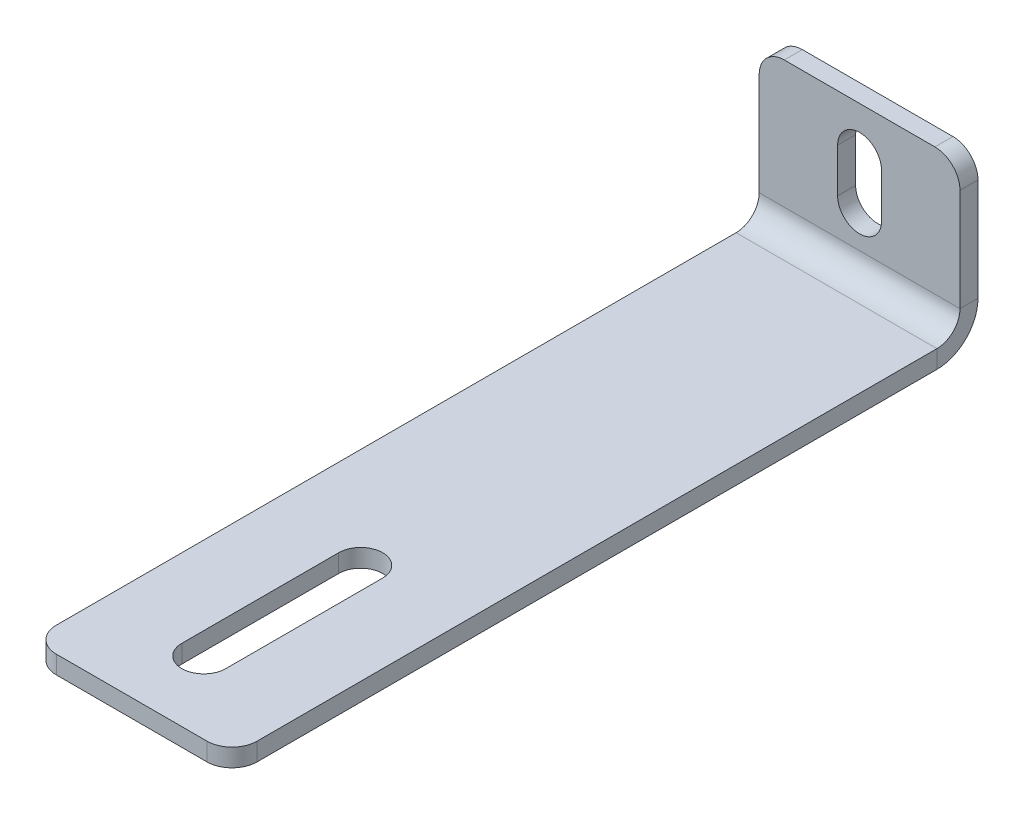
ISO-10303-21;
HEADER;
FILE_DESCRIPTION(('STEP AP214'),'2;1');
FILE_NAME('part.step','',(''),(''),'','','');
FILE_SCHEMA(('AUTOMOTIVE_DESIGN { 1 0 10303 214 1 1 1 1 }'));
ENDSEC;
DATA;
#1=APPLICATION_CONTEXT('core data for automotive mechanical design processes');
#2=APPLICATION_PROTOCOL_DEFINITION('international standard','automotive_design',2000,#1);
#3=PRODUCT_CONTEXT('',#1,'mechanical');
#4=PRODUCT('Part','Part','',(#3));
#5=PRODUCT_RELATED_PRODUCT_CATEGORY('part','',(#4));
#6=PRODUCT_DEFINITION_FORMATION('','',#4);
#7=PRODUCT_DEFINITION_CONTEXT('part definition',#1,'design');
#8=PRODUCT_DEFINITION('design','',#6,#7);
#9=PRODUCT_DEFINITION_SHAPE('','',#8);
#10=(LENGTH_UNIT() NAMED_UNIT(*) SI_UNIT(.MILLI.,.METRE.));
#11=(NAMED_UNIT(*) PLANE_ANGLE_UNIT() SI_UNIT($,.RADIAN.));
#12=(NAMED_UNIT(*) SI_UNIT($,.STERADIAN.) SOLID_ANGLE_UNIT());
#13=UNCERTAINTY_MEASURE_WITH_UNIT(LENGTH_MEASURE(1.E-05),#10,'distance_accuracy_value','');
#14=(GEOMETRIC_REPRESENTATION_CONTEXT(3) GLOBAL_UNCERTAINTY_ASSIGNED_CONTEXT((#13)) GLOBAL_UNIT_ASSIGNED_CONTEXT((#10,
#11,#12)) REPRESENTATION_CONTEXT('',''));
#15=CARTESIAN_POINT('',(0.,0.,0.));
#16=DIRECTION('',(0.,0.,1.));
#17=DIRECTION('',(1.,0.,0.));
#18=AXIS2_PLACEMENT_3D('',#15,#16,#17);
#19=CARTESIAN_POINT('',(5.55625,15.08125,-4.55522));
#20=DIRECTION('',(1.,0.,0.));
#21=DIRECTION('',(0.,1.,0.));
#22=AXIS2_PLACEMENT_3D('',#19,#20,#21);
#23=PLANE('',#22);
#24=DIRECTION('',(0.,-1.,0.));
#25=VECTOR('',#24,1.);
#26=CARTESIAN_POINT('',(5.55625,15.08125,-4.55422));
#27=LINE('',#26,#25);
#28=CARTESIAN_POINT('',(5.55625,26.19375,-4.55422));
#29=VERTEX_POINT('',#28);
#30=CARTESIAN_POINT('',(5.55625,15.08125,-4.55422));
#31=VERTEX_POINT('',#30);
#32=EDGE_CURVE('E182',#29,#31,#27,.T.);
#33=ORIENTED_EDGE('',*,*,#32,.T.);
#34=DIRECTION('',(0.,0.,1.));
#35=VECTOR('',#34,1.);
#36=CARTESIAN_POINT('',(5.55625,15.08125,-4.55522));
#37=LINE('',#36,#35);
#38=CARTESIAN_POINT('',(5.55625,15.08125,0.));
#39=VERTEX_POINT('',#38);
#40=EDGE_CURVE('E235',#31,#39,#37,.T.);
#41=ORIENTED_EDGE('',*,*,#40,.T.);
#42=DIRECTION('',(0.,1.,0.));
#43=VECTOR('',#42,1.);
#44=CARTESIAN_POINT('',(5.55625,15.08125,0.));
#45=LINE('',#44,#43);
#46=CARTESIAN_POINT('',(5.55625,26.19375,0.));
#47=VERTEX_POINT('',#46);
#48=EDGE_CURVE('E185',#39,#47,#45,.T.);
#49=ORIENTED_EDGE('',*,*,#48,.T.);
#50=DIRECTION('',(0.,0.,1.));
#51=VECTOR('',#50,1.);
#52=CARTESIAN_POINT('',(5.55625,26.19375,-4.55522));
#53=LINE('',#52,#51);
#54=EDGE_CURVE('E9',#29,#47,#53,.T.);
#55=ORIENTED_EDGE('',*,*,#54,.F.);
#56=EDGE_LOOP('',(#33,#41,#49,#55));
#57=FACE_BOUND('',#56,.T.);
#58=ADVANCED_FACE('F14',(#57),#23,.F.);
#59=CARTESIAN_POINT('',(0.,26.19375,-4.55522));
#60=DIRECTION('',(0.,0.,1.));
#61=DIRECTION('',(1.,0.,0.));
#62=AXIS2_PLACEMENT_3D('',#59,#60,#61);
#63=CYLINDRICAL_SURFACE('',#62,5.55625);
#64=CARTESIAN_POINT('',(0.,26.19375,-4.55422));
#65=DIRECTION('',(0.,0.,-1.));
#66=DIRECTION('',(1.,0.,0.));
#67=AXIS2_PLACEMENT_3D('',#64,#65,#66);
#68=CIRCLE('',#67,5.55625);
#69=CARTESIAN_POINT('',(-5.55625,26.19375,-4.55422));
#70=VERTEX_POINT('',#69);
#71=EDGE_CURVE('E190',#70,#29,#68,.T.);
#72=ORIENTED_EDGE('',*,*,#71,.T.);
#73=ORIENTED_EDGE('',*,*,#54,.T.);
#74=CARTESIAN_POINT('',(0.,26.19375,0.));
#75=DIRECTION('',(0.,0.,1.));
#76=DIRECTION('',(1.,0.,0.));
#77=AXIS2_PLACEMENT_3D('',#74,#75,#76);
#78=CIRCLE('',#77,5.55625);
#79=CARTESIAN_POINT('',(-5.55625,26.19375,0.));
#80=VERTEX_POINT('',#79);
#81=EDGE_CURVE('E284',#47,#80,#78,.T.);
#82=ORIENTED_EDGE('',*,*,#81,.T.);
#83=DIRECTION('',(0.,0.,1.));
#84=VECTOR('',#83,1.);
#85=CARTESIAN_POINT('',(-5.55625,26.19375,-4.55522));
#86=LINE('',#85,#84);
#87=EDGE_CURVE('E25',#70,#80,#86,.T.);
#88=ORIENTED_EDGE('',*,*,#87,.F.);
#89=EDGE_LOOP('',(#72,#73,#82,#88));
#90=FACE_BOUND('',#89,.T.);
#91=ADVANCED_FACE('F191',(#90),#63,.F.);
#92=CARTESIAN_POINT('',(-5.55625,15.08125,-4.55522));
#93=DIRECTION('',(-1.,0.,0.));
#94=DIRECTION('',(0.,1.,0.));
#95=AXIS2_PLACEMENT_3D('',#92,#93,#94);
#96=PLANE('',#95);
#97=DIRECTION('',(0.,1.,0.));
#98=VECTOR('',#97,1.);
#99=CARTESIAN_POINT('',(-5.55625,15.08125,-4.55422));
#100=LINE('',#99,#98);
#101=CARTESIAN_POINT('',(-5.55625,15.08125,-4.55422));
#102=VERTEX_POINT('',#101);
#103=EDGE_CURVE('E208',#102,#70,#100,.T.);
#104=ORIENTED_EDGE('',*,*,#103,.T.);
#105=ORIENTED_EDGE('',*,*,#87,.T.);
#106=DIRECTION('',(0.,-1.,0.));
#107=VECTOR('',#106,1.);
#108=CARTESIAN_POINT('',(-5.55625,15.08125,0.));
#109=LINE('',#108,#107);
#110=CARTESIAN_POINT('',(-5.55625,15.08125,0.));
#111=VERTEX_POINT('',#110);
#112=EDGE_CURVE('E287',#80,#111,#109,.T.);
#113=ORIENTED_EDGE('',*,*,#112,.T.);
#114=DIRECTION('',(0.,0.,1.));
#115=VECTOR('',#114,1.);
#116=CARTESIAN_POINT('',(-5.55625,15.08125,-4.55522));
#117=LINE('',#116,#115);
#118=EDGE_CURVE('E238',#102,#111,#117,.T.);
#119=ORIENTED_EDGE('',*,*,#118,.F.);
#120=EDGE_LOOP('',(#104,#105,#113,#119));
#121=FACE_BOUND('',#120,.T.);
#122=ADVANCED_FACE('F518',(#121),#96,.F.);
#123=CARTESIAN_POINT('',(0.,15.08125,-4.55522));
#124=DIRECTION('',(0.,0.,1.));
#125=DIRECTION('',(1.,0.,0.));
#126=AXIS2_PLACEMENT_3D('',#123,#124,#125);
#127=CYLINDRICAL_SURFACE('',#126,5.55625);
#128=CARTESIAN_POINT('',(0.,15.08125,-4.55422));
#129=DIRECTION('',(0.,0.,-1.));
#130=DIRECTION('',(1.,0.,0.));
#131=AXIS2_PLACEMENT_3D('',#128,#129,#130);
#132=CIRCLE('',#131,5.55625);
#133=EDGE_CURVE('E201',#31,#102,#132,.T.);
#134=ORIENTED_EDGE('',*,*,#133,.T.);
#135=ORIENTED_EDGE('',*,*,#118,.T.);
#136=CARTESIAN_POINT('',(0.,15.08125,0.));
#137=DIRECTION('',(0.,0.,1.));
#138=DIRECTION('',(1.,0.,0.));
#139=AXIS2_PLACEMENT_3D('',#136,#137,#138);
#140=CIRCLE('',#139,5.55625);
#141=EDGE_CURVE('E303',#111,#39,#140,.T.);
#142=ORIENTED_EDGE('',*,*,#141,.T.);
#143=ORIENTED_EDGE('',*,*,#40,.F.);
#144=EDGE_LOOP('',(#134,#135,#142,#143));
#145=FACE_BOUND('',#144,.T.);
#146=ADVANCED_FACE('F509',(#145),#127,.F.);
#147=CARTESIAN_POINT('',(5.55625,-4.55522,165.89375));
#148=DIRECTION('',(1.,0.,0.));
#149=DIRECTION('',(0.,0.,-1.));
#150=AXIS2_PLACEMENT_3D('',#147,#148,#149);
#151=PLANE('',#150);
#152=DIRECTION('',(0.,0.,1.));
#153=VECTOR('',#152,1.);
#154=CARTESIAN_POINT('',(5.55625,-4.55422,165.89375));
#155=LINE('',#154,#153);
#156=CARTESIAN_POINT('',(5.55625,-4.55422,126.20625));
#157=VERTEX_POINT('',#156);
#158=CARTESIAN_POINT('',(5.55625,-4.55422,165.89375));
#159=VERTEX_POINT('',#158);
#160=EDGE_CURVE('E229',#157,#159,#155,.T.);
#161=ORIENTED_EDGE('',*,*,#160,.T.);
#162=DIRECTION('',(0.,1.,0.));
#163=VECTOR('',#162,1.);
#164=CARTESIAN_POINT('',(5.55625,-4.55522,165.89375));
#165=LINE('',#164,#163);
#166=CARTESIAN_POINT('',(5.55625,0.,165.89375));
#167=VERTEX_POINT('',#166);
#168=EDGE_CURVE('E319',#159,#167,#165,.T.);
#169=ORIENTED_EDGE('',*,*,#168,.T.);
#170=DIRECTION('',(0.,0.,-1.));
#171=VECTOR('',#170,1.);
#172=CARTESIAN_POINT('',(5.55625,0.,165.89375));
#173=LINE('',#172,#171);
#174=CARTESIAN_POINT('',(5.55625,0.,126.20625));
#175=VERTEX_POINT('',#174);
#176=EDGE_CURVE('E283',#167,#175,#173,.T.);
#177=ORIENTED_EDGE('',*,*,#176,.T.);
#178=DIRECTION('',(0.,1.,0.));
#179=VECTOR('',#178,1.);
#180=CARTESIAN_POINT('',(5.55625,-4.55522,126.20625));
#181=LINE('',#180,#179);
#182=EDGE_CURVE('E40',#157,#175,#181,.T.);
#183=ORIENTED_EDGE('',*,*,#182,.F.);
#184=EDGE_LOOP('',(#161,#169,#177,#183));
#185=FACE_BOUND('',#184,.T.);
#186=ADVANCED_FACE('F491',(#185),#151,.F.);
#187=CARTESIAN_POINT('',(0.,-4.55522,126.20625));
#188=DIRECTION('',(0.,1.,0.));
#189=DIRECTION('',(0.,0.,1.));
#190=AXIS2_PLACEMENT_3D('',#187,#188,#189);
#191=CYLINDRICAL_SURFACE('',#190,5.55625);
#192=CARTESIAN_POINT('',(0.,-4.55422,126.20625));
#193=DIRECTION('',(0.,-1.,0.));
#194=DIRECTION('',(0.,0.,1.));
#195=AXIS2_PLACEMENT_3D('',#192,#193,#194);
#196=CIRCLE('',#195,5.55625);
#197=CARTESIAN_POINT('',(-5.55625,-4.55422,126.20625));
#198=VERTEX_POINT('',#197);
#199=EDGE_CURVE('E298',#198,#157,#196,.T.);
#200=ORIENTED_EDGE('',*,*,#199,.T.);
#201=ORIENTED_EDGE('',*,*,#182,.T.);
#202=CARTESIAN_POINT('',(0.,0.,126.20625));
#203=DIRECTION('',(0.,1.,0.));
#204=DIRECTION('',(0.,0.,1.));
#205=AXIS2_PLACEMENT_3D('',#202,#203,#204);
#206=CIRCLE('',#205,5.55625);
#207=CARTESIAN_POINT('',(-5.55625,0.,126.20625));
#208=VERTEX_POINT('',#207);
#209=EDGE_CURVE('E360',#175,#208,#206,.T.);
#210=ORIENTED_EDGE('',*,*,#209,.T.);
#211=DIRECTION('',(0.,1.,0.));
#212=VECTOR('',#211,1.);
#213=CARTESIAN_POINT('',(-5.55625,-4.55522,126.20625));
#214=LINE('',#213,#212);
#215=EDGE_CURVE('E158',#198,#208,#214,.T.);
#216=ORIENTED_EDGE('',*,*,#215,.F.);
#217=EDGE_LOOP('',(#200,#201,#210,#216));
#218=FACE_BOUND('',#217,.T.);
#219=ADVANCED_FACE('F500',(#218),#191,.F.);
#220=CARTESIAN_POINT('',(-5.55625,-4.55522,165.89375));
#221=DIRECTION('',(-1.,0.,0.));
#222=DIRECTION('',(0.,0.,1.));
#223=AXIS2_PLACEMENT_3D('',#220,#221,#222);
#224=PLANE('',#223);
#225=DIRECTION('',(0.,0.,-1.));
#226=VECTOR('',#225,1.);
#227=CARTESIAN_POINT('',(-5.55625,-4.55422,165.89375));
#228=LINE('',#227,#226);
#229=CARTESIAN_POINT('',(-5.55625,-4.55422,165.89375));
#230=VERTEX_POINT('',#229);
#231=EDGE_CURVE('E230',#230,#198,#228,.T.);
#232=ORIENTED_EDGE('',*,*,#231,.T.);
#233=ORIENTED_EDGE('',*,*,#215,.T.);
#234=DIRECTION('',(0.,0.,1.));
#235=VECTOR('',#234,1.);
#236=CARTESIAN_POINT('',(-5.55625,0.,165.89375));
#237=LINE('',#236,#235);
#238=CARTESIAN_POINT('',(-5.55625,0.,165.89375));
#239=VERTEX_POINT('',#238);
#240=EDGE_CURVE('E376',#208,#239,#237,.T.);
#241=ORIENTED_EDGE('',*,*,#240,.T.);
#242=DIRECTION('',(0.,1.,0.));
#243=VECTOR('',#242,1.);
#244=CARTESIAN_POINT('',(-5.55625,-4.55522,165.89375));
#245=LINE('',#244,#243);
#246=EDGE_CURVE('E332',#230,#239,#245,.T.);
#247=ORIENTED_EDGE('',*,*,#246,.F.);
#248=EDGE_LOOP('',(#232,#233,#241,#247));
#249=FACE_BOUND('',#248,.T.);
#250=ADVANCED_FACE('F487',(#249),#224,.F.);
#251=CARTESIAN_POINT('',(0.,-4.55522,165.89375));
#252=DIRECTION('',(0.,1.,0.));
#253=DIRECTION('',(0.,0.,1.));
#254=AXIS2_PLACEMENT_3D('',#251,#252,#253);
#255=CYLINDRICAL_SURFACE('',#254,5.55625);
#256=CARTESIAN_POINT('',(0.,-4.55422,165.89375));
#257=DIRECTION('',(0.,-1.,0.));
#258=DIRECTION('',(0.,0.,1.));
#259=AXIS2_PLACEMENT_3D('',#256,#257,#258);
#260=CIRCLE('',#259,5.55625);
#261=EDGE_CURVE('E225',#159,#230,#260,.T.);
#262=ORIENTED_EDGE('',*,*,#261,.T.);
#263=ORIENTED_EDGE('',*,*,#246,.T.);
#264=CARTESIAN_POINT('',(0.,0.,165.89375));
#265=DIRECTION('',(0.,1.,0.));
#266=DIRECTION('',(0.,0.,1.));
#267=AXIS2_PLACEMENT_3D('',#264,#265,#266);
#268=CIRCLE('',#267,5.55625);
#269=EDGE_CURVE('E379',#239,#167,#268,.T.);
#270=ORIENTED_EDGE('',*,*,#269,.T.);
#271=ORIENTED_EDGE('',*,*,#168,.F.);
#272=EDGE_LOOP('',(#262,#263,#270,#271));
#273=FACE_BOUND('',#272,.T.);
#274=ADVANCED_FACE('F482',(#273),#255,.F.);
#275=CARTESIAN_POINT('',(19.05,31.75,0.));
#276=DIRECTION('',(0.,0.,-1.));
#277=DIRECTION('',(-1.,0.,0.));
#278=AXIS2_PLACEMENT_3D('',#275,#276,#277);
#279=CYLINDRICAL_SURFACE('',#278,6.35);
#280=CARTESIAN_POINT('',(19.05,31.75,0.));
#281=DIRECTION('',(0.,0.,1.));
#282=DIRECTION('',(1.,0.,0.));
#283=AXIS2_PLACEMENT_3D('',#280,#281,#282);
#284=CIRCLE('',#283,6.35);
#285=CARTESIAN_POINT('',(25.4,31.75,0.));
#286=VERTEX_POINT('',#285);
#287=CARTESIAN_POINT('',(19.05,38.1,0.));
#288=VERTEX_POINT('',#287);
#289=EDGE_CURVE('E299',#286,#288,#284,.T.);
#290=ORIENTED_EDGE('',*,*,#289,.F.);
#291=DIRECTION('',(0.,0.,1.));
#292=VECTOR('',#291,1.);
#293=CARTESIAN_POINT('',(25.4,31.75,5.842));
#294=LINE('',#293,#292);
#295=CARTESIAN_POINT('',(25.4,31.75,-4.55422));
#296=VERTEX_POINT('',#295);
#297=EDGE_CURVE('E275',#296,#286,#294,.T.);
#298=ORIENTED_EDGE('',*,*,#297,.F.);
#299=CARTESIAN_POINT('',(19.05,31.75,-4.55422));
#300=DIRECTION('',(0.,0.,-1.));
#301=DIRECTION('',(1.,0.,0.));
#302=AXIS2_PLACEMENT_3D('',#299,#300,#301);
#303=CIRCLE('',#302,6.35);
#304=CARTESIAN_POINT('',(19.05,38.1,-4.55422));
#305=VERTEX_POINT('',#304);
#306=EDGE_CURVE('E234',#305,#296,#303,.T.);
#307=ORIENTED_EDGE('',*,*,#306,.F.);
#308=DIRECTION('',(0.,0.,-1.));
#309=VECTOR('',#308,1.);
#310=CARTESIAN_POINT('',(19.05,38.1,0.));
#311=LINE('',#310,#309);
#312=EDGE_CURVE('E244',#288,#305,#311,.T.);
#313=ORIENTED_EDGE('',*,*,#312,.F.);
#314=EDGE_LOOP('',(#290,#298,#307,#313));
#315=FACE_BOUND('',#314,.T.);
#316=ADVANCED_FACE('F554',(#315),#279,.T.);
#317=CARTESIAN_POINT('',(-19.05,31.75,5.842));
#318=DIRECTION('',(0.,0.,-1.));
#319=DIRECTION('',(-1.,0.,0.));
#320=AXIS2_PLACEMENT_3D('',#317,#318,#319);
#321=CYLINDRICAL_SURFACE('',#320,6.35);
#322=CARTESIAN_POINT('',(-19.05,31.75,0.));
#323=DIRECTION('',(0.,0.,1.));
#324=DIRECTION('',(1.,0.,0.));
#325=AXIS2_PLACEMENT_3D('',#322,#323,#324);
#326=CIRCLE('',#325,6.35);
#327=CARTESIAN_POINT('',(-19.05,38.1,0.));
#328=VERTEX_POINT('',#327);
#329=CARTESIAN_POINT('',(-25.4,31.75,0.));
#330=VERTEX_POINT('',#329);
#331=EDGE_CURVE('E239',#328,#330,#326,.T.);
#332=ORIENTED_EDGE('',*,*,#331,.F.);
#333=DIRECTION('',(0.,0.,1.));
#334=VECTOR('',#333,1.);
#335=CARTESIAN_POINT('',(-19.05,38.1,0.));
#336=LINE('',#335,#334);
#337=CARTESIAN_POINT('',(-19.05,38.1,-4.55422));
#338=VERTEX_POINT('',#337);
#339=EDGE_CURVE('E196',#338,#328,#336,.T.);
#340=ORIENTED_EDGE('',*,*,#339,.F.);
#341=CARTESIAN_POINT('',(-19.05,31.75,-4.55422));
#342=DIRECTION('',(0.,0.,-1.));
#343=DIRECTION('',(1.,0.,0.));
#344=AXIS2_PLACEMENT_3D('',#341,#342,#343);
#345=CIRCLE('',#344,6.35);
#346=CARTESIAN_POINT('',(-25.4,31.75,-4.55422));
#347=VERTEX_POINT('',#346);
#348=EDGE_CURVE('E308',#347,#338,#345,.T.);
#349=ORIENTED_EDGE('',*,*,#348,.F.);
#350=DIRECTION('',(0.,0.,-1.));
#351=VECTOR('',#350,1.);
#352=CARTESIAN_POINT('',(-25.4,31.75,5.842));
#353=LINE('',#352,#351);
#354=EDGE_CURVE('E212',#330,#347,#353,.T.);
#355=ORIENTED_EDGE('',*,*,#354,.F.);
#356=EDGE_LOOP('',(#332,#340,#349,#355));
#357=FACE_BOUND('',#356,.T.);
#358=ADVANCED_FACE('F544',(#357),#321,.T.);
#359=CARTESIAN_POINT('',(19.05,-4.55422,177.8));
#360=DIRECTION('',(0.,-1.,0.));
#361=DIRECTION('',(0.,0.,-1.));
#362=AXIS2_PLACEMENT_3D('',#359,#360,#361);
#363=CYLINDRICAL_SURFACE('',#362,6.35);
#364=CARTESIAN_POINT('',(19.05,-4.55422,177.8));
#365=DIRECTION('',(0.,-1.,0.));
#366=DIRECTION('',(0.,0.,1.));
#367=AXIS2_PLACEMENT_3D('',#364,#365,#366);
#368=CIRCLE('',#367,6.35);
#369=CARTESIAN_POINT('',(25.4,-4.55422,177.8));
#370=VERTEX_POINT('',#369);
#371=CARTESIAN_POINT('',(19.05,-4.55422,184.15));
#372=VERTEX_POINT('',#371);
#373=EDGE_CURVE('E223',#370,#372,#368,.T.);
#374=ORIENTED_EDGE('',*,*,#373,.F.);
#375=DIRECTION('',(0.,-1.,0.));
#376=VECTOR('',#375,1.);
#377=CARTESIAN_POINT('',(25.4,-4.55422,177.8));
#378=LINE('',#377,#376);
#379=CARTESIAN_POINT('',(25.4,0.,177.8));
#380=VERTEX_POINT('',#379);
#381=EDGE_CURVE('E341',#380,#370,#378,.T.);
#382=ORIENTED_EDGE('',*,*,#381,.F.);
#383=CARTESIAN_POINT('',(19.05,0.,177.8));
#384=DIRECTION('',(0.,1.,0.));
#385=DIRECTION('',(0.,0.,1.));
#386=AXIS2_PLACEMENT_3D('',#383,#384,#385);
#387=CIRCLE('',#386,6.35);
#388=CARTESIAN_POINT('',(19.05,0.,184.15));
#389=VERTEX_POINT('',#388);
#390=EDGE_CURVE('E361',#389,#380,#387,.T.);
#391=ORIENTED_EDGE('',*,*,#390,.F.);
#392=DIRECTION('',(0.,1.,0.));
#393=VECTOR('',#392,1.);
#394=CARTESIAN_POINT('',(19.05,0.,184.15));
#395=LINE('',#394,#393);
#396=EDGE_CURVE('E247',#372,#389,#395,.T.);
#397=ORIENTED_EDGE('',*,*,#396,.F.);
#398=EDGE_LOOP('',(#374,#382,#391,#397));
#399=FACE_BOUND('',#398,.T.);
#400=ADVANCED_FACE('F530',(#399),#363,.T.);
#401=CARTESIAN_POINT('',(-19.05,5.842,177.8));
#402=DIRECTION('',(0.,1.,0.));
#403=DIRECTION('',(0.,0.,1.));
#404=AXIS2_PLACEMENT_3D('',#401,#402,#403);
#405=CYLINDRICAL_SURFACE('',#404,6.35);
#406=CARTESIAN_POINT('',(-19.05,-4.55422,177.8));
#407=DIRECTION('',(0.,-1.,0.));
#408=DIRECTION('',(0.,0.,1.));
#409=AXIS2_PLACEMENT_3D('',#406,#407,#408);
#410=CIRCLE('',#409,6.35);
#411=CARTESIAN_POINT('',(-19.05,-4.55422,184.15));
#412=VERTEX_POINT('',#411);
#413=CARTESIAN_POINT('',(-25.4,-4.55422,177.8));
#414=VERTEX_POINT('',#413);
#415=EDGE_CURVE('E111',#412,#414,#410,.T.);
#416=ORIENTED_EDGE('',*,*,#415,.F.);
#417=DIRECTION('',(0.,-1.,0.));
#418=VECTOR('',#417,1.);
#419=CARTESIAN_POINT('',(-19.05,-4.55422,184.15));
#420=LINE('',#419,#418);
#421=CARTESIAN_POINT('',(-19.05,0.,184.15));
#422=VERTEX_POINT('',#421);
#423=EDGE_CURVE('E248',#422,#412,#420,.T.);
#424=ORIENTED_EDGE('',*,*,#423,.F.);
#425=CARTESIAN_POINT('',(-19.05,0.,177.8));
#426=DIRECTION('',(0.,1.,0.));
#427=DIRECTION('',(0.,0.,1.));
#428=AXIS2_PLACEMENT_3D('',#425,#426,#427);
#429=CIRCLE('',#428,6.35);
#430=CARTESIAN_POINT('',(-25.4,0.,177.8));
#431=VERTEX_POINT('',#430);
#432=EDGE_CURVE('E93',#431,#422,#429,.T.);
#433=ORIENTED_EDGE('',*,*,#432,.F.);
#434=DIRECTION('',(0.,1.,0.));
#435=VECTOR('',#434,1.);
#436=CARTESIAN_POINT('',(-25.4,5.842,177.8));
#437=LINE('',#436,#435);
#438=EDGE_CURVE('E290',#414,#431,#437,.T.);
#439=ORIENTED_EDGE('',*,*,#438,.F.);
#440=EDGE_LOOP('',(#416,#424,#433,#439));
#441=FACE_BOUND('',#440,.T.);
#442=ADVANCED_FACE('F527',(#441),#405,.T.);
#443=CARTESIAN_POINT('',(-25.4,5.842,5.842));
#444=DIRECTION('',(-1.,0.,0.));
#445=DIRECTION('',(0.,0.,1.));
#446=AXIS2_PLACEMENT_3D('',#443,#444,#445);
#447=PLANE('',#446);
#448=DIRECTION('',(0.,1.,0.));
#449=VECTOR('',#448,1.);
#450=CARTESIAN_POINT('',(-25.4,0.,0.));
#451=LINE('',#450,#449);
#452=CARTESIAN_POINT('',(-25.4,5.842,0.));
#453=VERTEX_POINT('',#452);
#454=EDGE_CURVE('E243',#453,#330,#451,.T.);
#455=ORIENTED_EDGE('',*,*,#454,.T.);
#456=ORIENTED_EDGE('',*,*,#354,.T.);
#457=DIRECTION('',(0.,1.,0.));
#458=VECTOR('',#457,1.);
#459=CARTESIAN_POINT('',(-25.4,0.,-4.55422));
#460=LINE('',#459,#458);
#461=CARTESIAN_POINT('',(-25.4,5.842,-4.55422));
#462=VERTEX_POINT('',#461);
#463=EDGE_CURVE('E305',#462,#347,#460,.T.);
#464=ORIENTED_EDGE('',*,*,#463,.F.);
#465=DIRECTION('',(0.,0.,1.));
#466=VECTOR('',#465,1.);
#467=CARTESIAN_POINT('',(-25.4,5.842,-4.55422));
#468=LINE('',#467,#466);
#469=EDGE_CURVE('E313',#462,#453,#468,.T.);
#470=ORIENTED_EDGE('',*,*,#469,.T.);
#471=EDGE_LOOP('',(#455,#456,#464,#470));
#472=FACE_BOUND('',#471,.T.);
#473=ADVANCED_FACE('F524',(#472),#447,.T.);
#474=CARTESIAN_POINT('',(25.4,5.842,5.842));
#475=DIRECTION('',(-1.,0.,0.));
#476=DIRECTION('',(0.,0.,1.));
#477=AXIS2_PLACEMENT_3D('',#474,#475,#476);
#478=PLANE('',#477);
#479=DIRECTION('',(0.,0.,-1.));
#480=VECTOR('',#479,1.);
#481=CARTESIAN_POINT('',(25.4,0.,184.15));
#482=LINE('',#481,#480);
#483=CARTESIAN_POINT('',(25.4,0.,5.842));
#484=VERTEX_POINT('',#483);
#485=EDGE_CURVE('E365',#380,#484,#482,.T.);
#486=ORIENTED_EDGE('',*,*,#485,.F.);
#487=ORIENTED_EDGE('',*,*,#381,.T.);
#488=DIRECTION('',(0.,0.,-1.));
#489=VECTOR('',#488,1.);
#490=CARTESIAN_POINT('',(25.4,-4.55422,184.15));
#491=LINE('',#490,#489);
#492=CARTESIAN_POINT('',(25.4,-4.55422,5.842));
#493=VERTEX_POINT('',#492);
#494=EDGE_CURVE('E220',#370,#493,#491,.T.);
#495=ORIENTED_EDGE('',*,*,#494,.T.);
#496=DIRECTION('',(0.,1.,0.));
#497=VECTOR('',#496,1.);
#498=CARTESIAN_POINT('',(25.4,-4.55422,5.842));
#499=LINE('',#498,#497);
#500=EDGE_CURVE('E269',#493,#484,#499,.T.);
#501=ORIENTED_EDGE('',*,*,#500,.T.);
#502=EDGE_LOOP('',(#486,#487,#495,#501));
#503=FACE_BOUND('',#502,.T.);
#504=ADVANCED_FACE('F433',(#503),#478,.F.);
#505=CARTESIAN_POINT('',(25.4,5.842,5.842));
#506=DIRECTION('',(-1.,0.,0.));
#507=DIRECTION('',(0.,0.,1.));
#508=AXIS2_PLACEMENT_3D('',#505,#506,#507);
#509=CYLINDRICAL_SURFACE('',#508,10.39622);
#510=CARTESIAN_POINT('',(-25.4,5.842,5.842));
#511=DIRECTION('',(1.,0.,0.));
#512=DIRECTION('',(0.,0.,-1.));
#513=AXIS2_PLACEMENT_3D('',#510,#511,#512);
#514=CIRCLE('',#513,10.39622);
#515=CARTESIAN_POINT('',(-25.4,-4.55422,5.842));
#516=VERTEX_POINT('',#515);
#517=EDGE_CURVE('E18',#516,#462,#514,.T.);
#518=ORIENTED_EDGE('',*,*,#517,.T.);
#519=DIRECTION('',(-1.,0.,0.));
#520=VECTOR('',#519,1.);
#521=CARTESIAN_POINT('',(25.4,5.842,-4.55422));
#522=LINE('',#521,#520);
#523=CARTESIAN_POINT('',(25.4,5.842,-4.55422));
#524=VERTEX_POINT('',#523);
#525=EDGE_CURVE('E231',#524,#462,#522,.T.);
#526=ORIENTED_EDGE('',*,*,#525,.F.);
#527=CARTESIAN_POINT('',(25.4,5.842,5.842));
#528=DIRECTION('',(1.,0.,0.));
#529=DIRECTION('',(0.,0.,-1.));
#530=AXIS2_PLACEMENT_3D('',#527,#528,#529);
#531=CIRCLE('',#530,10.39622);
#532=EDGE_CURVE('E273',#493,#524,#531,.T.);
#533=ORIENTED_EDGE('',*,*,#532,.F.);
#534=DIRECTION('',(-1.,0.,0.));
#535=VECTOR('',#534,1.);
#536=CARTESIAN_POINT('',(25.4,-4.55422,5.842));
#537=LINE('',#536,#535);
#538=EDGE_CURVE('E224',#493,#516,#537,.T.);
#539=ORIENTED_EDGE('',*,*,#538,.T.);
#540=EDGE_LOOP('',(#518,#526,#533,#539));
#541=FACE_BOUND('',#540,.T.);
#542=ADVANCED_FACE('F537',(#541),#509,.T.);
#543=CARTESIAN_POINT('',(25.4,-4.55422,184.15));
#544=DIRECTION('',(0.,1.,0.));
#545=DIRECTION('',(1.,0.,0.));
#546=AXIS2_PLACEMENT_3D('',#543,#544,#545);
#547=PLANE('',#546);
#548=ORIENTED_EDGE('',*,*,#231,.F.);
#549=ORIENTED_EDGE('',*,*,#261,.F.);
#550=ORIENTED_EDGE('',*,*,#160,.F.);
#551=ORIENTED_EDGE('',*,*,#199,.F.);
#552=EDGE_LOOP('',(#548,#549,#550,#551));
#553=FACE_BOUND('',#552,.T.);
#554=DIRECTION('',(-1.,0.,0.));
#555=VECTOR('',#554,1.);
#556=CARTESIAN_POINT('',(25.4,-4.55422,184.15));
#557=LINE('',#556,#555);
#558=EDGE_CURVE('E245',#372,#412,#557,.T.);
#559=ORIENTED_EDGE('',*,*,#558,.T.);
#560=ORIENTED_EDGE('',*,*,#415,.T.);
#561=DIRECTION('',(0.,0.,-1.));
#562=VECTOR('',#561,1.);
#563=CARTESIAN_POINT('',(-25.4,-4.55422,184.15));
#564=LINE('',#563,#562);
#565=EDGE_CURVE('E295',#414,#516,#564,.T.);
#566=ORIENTED_EDGE('',*,*,#565,.T.);
#567=ORIENTED_EDGE('',*,*,#538,.F.);
#568=ORIENTED_EDGE('',*,*,#494,.F.);
#569=ORIENTED_EDGE('',*,*,#373,.T.);
#570=EDGE_LOOP('',(#559,#560,#566,#567,#568,#569));
#571=FACE_BOUND('',#570,.T.);
#572=ADVANCED_FACE('F495',(#553,#571),#547,.F.);
#573=CARTESIAN_POINT('',(25.4,-4.55422,184.15));
#574=DIRECTION('',(0.,0.,1.));
#575=DIRECTION('',(1.,0.,0.));
#576=AXIS2_PLACEMENT_3D('',#573,#574,#575);
#577=PLANE('',#576);
#578=DIRECTION('',(-1.,0.,0.));
#579=VECTOR('',#578,1.);
#580=CARTESIAN_POINT('',(25.4,0.,184.15));
#581=LINE('',#580,#579);
#582=EDGE_CURVE('E366',#389,#422,#581,.T.);
#583=ORIENTED_EDGE('',*,*,#582,.T.);
#584=ORIENTED_EDGE('',*,*,#423,.T.);
#585=ORIENTED_EDGE('',*,*,#558,.F.);
#586=ORIENTED_EDGE('',*,*,#396,.T.);
#587=EDGE_LOOP('',(#583,#584,#585,#586));
#588=FACE_BOUND('',#587,.T.);
#589=ADVANCED_FACE('F551',(#588),#577,.T.);
#590=CARTESIAN_POINT('',(25.4,0.,184.15));
#591=DIRECTION('',(0.,1.,0.));
#592=DIRECTION('',(1.,0.,0.));
#593=AXIS2_PLACEMENT_3D('',#590,#591,#592);
#594=PLANE('',#593);
#595=ORIENTED_EDGE('',*,*,#269,.F.);
#596=ORIENTED_EDGE('',*,*,#240,.F.);
#597=ORIENTED_EDGE('',*,*,#209,.F.);
#598=ORIENTED_EDGE('',*,*,#176,.F.);
#599=EDGE_LOOP('',(#595,#596,#597,#598));
#600=FACE_BOUND('',#599,.T.);
#601=DIRECTION('',(0.,0.,-1.));
#602=VECTOR('',#601,1.);
#603=CARTESIAN_POINT('',(-25.4,0.,184.15));
#604=LINE('',#603,#602);
#605=CARTESIAN_POINT('',(-25.4,0.,5.842));
#606=VERTEX_POINT('',#605);
#607=EDGE_CURVE('E294',#431,#606,#604,.T.);
#608=ORIENTED_EDGE('',*,*,#607,.F.);
#609=ORIENTED_EDGE('',*,*,#432,.T.);
#610=ORIENTED_EDGE('',*,*,#582,.F.);
#611=ORIENTED_EDGE('',*,*,#390,.T.);
#612=ORIENTED_EDGE('',*,*,#485,.T.);
#613=DIRECTION('',(-1.,0.,0.));
#614=VECTOR('',#613,1.);
#615=CARTESIAN_POINT('',(25.4,0.,5.842));
#616=LINE('',#615,#614);
#617=EDGE_CURVE('E331',#484,#606,#616,.T.);
#618=ORIENTED_EDGE('',*,*,#617,.T.);
#619=EDGE_LOOP('',(#608,#609,#610,#611,#612,#618));
#620=FACE_BOUND('',#619,.T.);
#621=ADVANCED_FACE('F16',(#600,#620),#594,.T.);
#622=CARTESIAN_POINT('',(25.4,5.842,5.842));
#623=DIRECTION('',(-1.,0.,0.));
#624=DIRECTION('',(0.,0.,1.));
#625=AXIS2_PLACEMENT_3D('',#622,#623,#624);
#626=CYLINDRICAL_SURFACE('',#625,5.842);
#627=CARTESIAN_POINT('',(-25.4,5.842,5.842));
#628=DIRECTION('',(1.,0.,0.));
#629=DIRECTION('',(0.,0.,1.));
#630=AXIS2_PLACEMENT_3D('',#627,#628,#629);
#631=CIRCLE('',#630,5.842);
#632=EDGE_CURVE('E218',#606,#453,#631,.T.);
#633=ORIENTED_EDGE('',*,*,#632,.F.);
#634=ORIENTED_EDGE('',*,*,#617,.F.);
#635=CARTESIAN_POINT('',(25.4,5.842,5.842));
#636=DIRECTION('',(1.,0.,0.));
#637=DIRECTION('',(0.,0.,1.));
#638=AXIS2_PLACEMENT_3D('',#635,#636,#637);
#639=CIRCLE('',#638,5.842);
#640=CARTESIAN_POINT('',(25.4,5.842,0.));
#641=VERTEX_POINT('',#640);
#642=EDGE_CURVE('E274',#484,#641,#639,.T.);
#643=ORIENTED_EDGE('',*,*,#642,.T.);
#644=DIRECTION('',(-1.,0.,0.));
#645=VECTOR('',#644,1.);
#646=CARTESIAN_POINT('',(25.4,5.842,0.));
#647=LINE('',#646,#645);
#648=EDGE_CURVE('E304',#641,#453,#647,.T.);
#649=ORIENTED_EDGE('',*,*,#648,.T.);
#650=EDGE_LOOP('',(#633,#634,#643,#649));
#651=FACE_BOUND('',#650,.T.);
#652=ADVANCED_FACE('F428',(#651),#626,.F.);
#653=CARTESIAN_POINT('',(25.4,0.,0.));
#654=DIRECTION('',(0.,0.,1.));
#655=DIRECTION('',(1.,0.,0.));
#656=AXIS2_PLACEMENT_3D('',#653,#654,#655);
#657=PLANE('',#656);
#658=ORIENTED_EDGE('',*,*,#141,.F.);
#659=ORIENTED_EDGE('',*,*,#112,.F.);
#660=ORIENTED_EDGE('',*,*,#81,.F.);
#661=ORIENTED_EDGE('',*,*,#48,.F.);
#662=EDGE_LOOP('',(#658,#659,#660,#661));
#663=FACE_BOUND('',#662,.T.);
#664=DIRECTION('',(-1.,0.,0.));
#665=VECTOR('',#664,1.);
#666=CARTESIAN_POINT('',(25.4,38.1,0.));
#667=LINE('',#666,#665);
#668=EDGE_CURVE('E268',#288,#328,#667,.T.);
#669=ORIENTED_EDGE('',*,*,#668,.T.);
#670=ORIENTED_EDGE('',*,*,#331,.T.);
#671=ORIENTED_EDGE('',*,*,#454,.F.);
#672=ORIENTED_EDGE('',*,*,#648,.F.);
#673=DIRECTION('',(0.,1.,0.));
#674=VECTOR('',#673,1.);
#675=CARTESIAN_POINT('',(25.4,0.,0.));
#676=LINE('',#675,#674);
#677=EDGE_CURVE('E219',#641,#286,#676,.T.);
#678=ORIENTED_EDGE('',*,*,#677,.T.);
#679=ORIENTED_EDGE('',*,*,#289,.T.);
#680=EDGE_LOOP('',(#669,#670,#671,#672,#678,#679));
#681=FACE_BOUND('',#680,.T.);
#682=ADVANCED_FACE('F447',(#663,#681),#657,.T.);
#683=CARTESIAN_POINT('',(25.4,38.1,0.));
#684=DIRECTION('',(0.,1.,0.));
#685=DIRECTION('',(1.,0.,0.));
#686=AXIS2_PLACEMENT_3D('',#683,#684,#685);
#687=PLANE('',#686);
#688=DIRECTION('',(-1.,0.,0.));
#689=VECTOR('',#688,1.);
#690=CARTESIAN_POINT('',(25.4,38.1,-4.55422));
#691=LINE('',#690,#689);
#692=EDGE_CURVE('E323',#305,#338,#691,.T.);
#693=ORIENTED_EDGE('',*,*,#692,.T.);
#694=ORIENTED_EDGE('',*,*,#339,.T.);
#695=ORIENTED_EDGE('',*,*,#668,.F.);
#696=ORIENTED_EDGE('',*,*,#312,.T.);
#697=EDGE_LOOP('',(#693,#694,#695,#696));
#698=FACE_BOUND('',#697,.T.);
#699=ADVANCED_FACE('F522',(#698),#687,.T.);
#700=CARTESIAN_POINT('',(25.4,0.,-4.55422));
#701=DIRECTION('',(0.,0.,1.));
#702=DIRECTION('',(1.,0.,0.));
#703=AXIS2_PLACEMENT_3D('',#700,#701,#702);
#704=PLANE('',#703);
#705=ORIENTED_EDGE('',*,*,#103,.F.);
#706=ORIENTED_EDGE('',*,*,#133,.F.);
#707=ORIENTED_EDGE('',*,*,#32,.F.);
#708=ORIENTED_EDGE('',*,*,#71,.F.);
#709=EDGE_LOOP('',(#705,#706,#707,#708));
#710=FACE_BOUND('',#709,.T.);
#711=ORIENTED_EDGE('',*,*,#463,.T.);
#712=ORIENTED_EDGE('',*,*,#348,.T.);
#713=ORIENTED_EDGE('',*,*,#692,.F.);
#714=ORIENTED_EDGE('',*,*,#306,.T.);
#715=DIRECTION('',(0.,1.,0.));
#716=VECTOR('',#715,1.);
#717=CARTESIAN_POINT('',(25.4,0.,-4.55422));
#718=LINE('',#717,#716);
#719=EDGE_CURVE('E279',#524,#296,#718,.T.);
#720=ORIENTED_EDGE('',*,*,#719,.F.);
#721=ORIENTED_EDGE('',*,*,#525,.T.);
#722=EDGE_LOOP('',(#711,#712,#713,#714,#720,#721));
#723=FACE_BOUND('',#722,.T.);
#724=ADVANCED_FACE('F198',(#710,#723),#704,.F.);
#725=CARTESIAN_POINT('',(-25.4,5.842,-4.55422));
#726=DIRECTION('',(-1.,0.,0.));
#727=DIRECTION('',(0.,0.,1.));
#728=AXIS2_PLACEMENT_3D('',#725,#726,#727);
#729=PLANE('',#728);
#730=ORIENTED_EDGE('',*,*,#565,.F.);
#731=ORIENTED_EDGE('',*,*,#438,.T.);
#732=ORIENTED_EDGE('',*,*,#607,.T.);
#733=DIRECTION('',(0.,-1.,0.));
#734=VECTOR('',#733,1.);
#735=CARTESIAN_POINT('',(-25.4,0.,5.842));
#736=LINE('',#735,#734);
#737=EDGE_CURVE('E214',#606,#516,#736,.T.);
#738=ORIENTED_EDGE('',*,*,#737,.T.);
#739=EDGE_LOOP('',(#730,#731,#732,#738));
#740=FACE_BOUND('',#739,.T.);
#741=ADVANCED_FACE('F548',(#740),#729,.T.);
#742=CARTESIAN_POINT('',(-25.4,0.,5.842));
#743=DIRECTION('',(-1.,0.,0.));
#744=DIRECTION('',(0.,0.,1.));
#745=AXIS2_PLACEMENT_3D('',#742,#743,#744);
#746=PLANE('',#745);
#747=ORIENTED_EDGE('',*,*,#737,.F.);
#748=ORIENTED_EDGE('',*,*,#632,.T.);
#749=ORIENTED_EDGE('',*,*,#469,.F.);
#750=ORIENTED_EDGE('',*,*,#517,.F.);
#751=EDGE_LOOP('',(#747,#748,#749,#750));
#752=FACE_BOUND('',#751,.T.);
#753=ADVANCED_FACE('F534',(#752),#746,.T.);
#754=CARTESIAN_POINT('',(25.4,-4.55422,5.842));
#755=DIRECTION('',(1.,0.,0.));
#756=DIRECTION('',(0.,1.,0.));
#757=AXIS2_PLACEMENT_3D('',#754,#755,#756);
#758=PLANE('',#757);
#759=ORIENTED_EDGE('',*,*,#719,.T.);
#760=ORIENTED_EDGE('',*,*,#297,.T.);
#761=ORIENTED_EDGE('',*,*,#677,.F.);
#762=DIRECTION('',(0.,0.,-1.));
#763=VECTOR('',#762,1.);
#764=CARTESIAN_POINT('',(25.4,5.842,0.));
#765=LINE('',#764,#763);
#766=EDGE_CURVE('E389',#641,#524,#765,.T.);
#767=ORIENTED_EDGE('',*,*,#766,.T.);
#768=EDGE_LOOP('',(#759,#760,#761,#767));
#769=FACE_BOUND('',#768,.T.);
#770=ADVANCED_FACE('F442',(#769),#758,.T.);
#771=CARTESIAN_POINT('',(25.4,5.842,0.));
#772=DIRECTION('',(1.,0.,0.));
#773=DIRECTION('',(0.,1.,0.));
#774=AXIS2_PLACEMENT_3D('',#771,#772,#773);
#775=PLANE('',#774);
#776=ORIENTED_EDGE('',*,*,#766,.F.);
#777=ORIENTED_EDGE('',*,*,#642,.F.);
#778=ORIENTED_EDGE('',*,*,#500,.F.);
#779=ORIENTED_EDGE('',*,*,#532,.T.);
#780=EDGE_LOOP('',(#776,#777,#778,#779));
#781=FACE_BOUND('',#780,.T.);
#782=ADVANCED_FACE('F437',(#781),#775,.T.);
#783=CLOSED_SHELL('',(#58,#91,#122,#146,#186,#219,#250,#274,#316,#358,#400,#442,#473,#504,#542,
#572,#589,#621,#652,#682,#699,#724,#741,#753,#770,#782));
#784=MANIFOLD_SOLID_BREP('B1',#783);
#785=ADVANCED_BREP_SHAPE_REPRESENTATION('',(#18,#784),#14);
#786=SHAPE_DEFINITION_REPRESENTATION(#9,#785);
ENDSEC;
END-ISO-10303-21;
